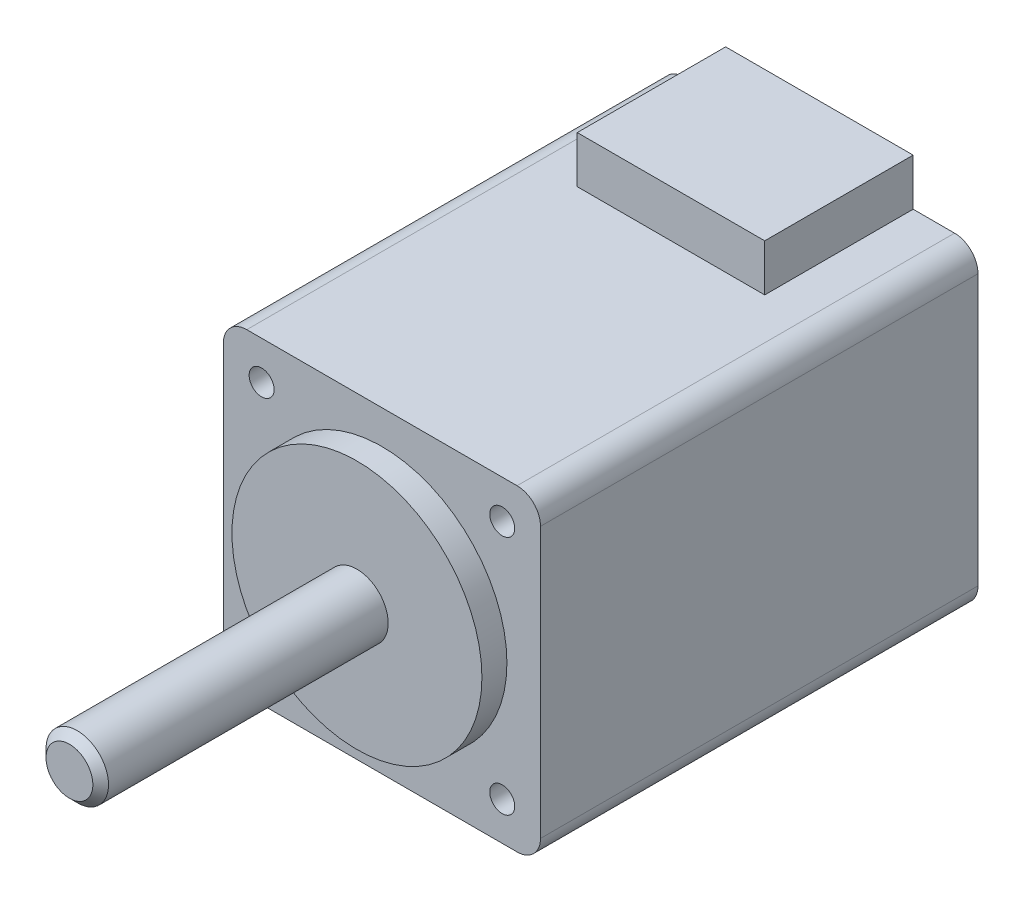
from build123d import *

# Parameters (mm, degrees)
SKETCH_1_R             = 8
EXTRUDE_1_DEPTH        = 1.6
SKETCH_2_R             = 2
EXTRUDE_2_DEPTH        = 18.4
CHAMFER_1_SIZE         = 0.5
EXTRUDE_3_DEPTH        = 28
EXTRUDE_4_DEPTH        = 9.5
HOLE_WIZARD_M2_1_D     = 1.6
HOLE_WIZARD_M2_1_DEPTH = 5.5
HOLE_WIZARD_M2_1_TIP   = 0.480688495


with BuildPart() as part:
    # Sketch 1 → Extrude 1 (new body)
    with BuildSketch(Plane.XY):
        Circle(SKETCH_1_R)
    extrude(amount=-EXTRUDE_1_DEPTH)

    # Sketch 2 → Extrude 2 (add)
    with BuildSketch(Plane.XY):
        Circle(SKETCH_2_R)
    extrude(amount=EXTRUDE_2_DEPTH)

    # Chamfer 1
    chamfer_1_edges = [part.edges().sort_by_distance(p)[0] for p in [
        (-2, 0, 18.4),
    ]]
    chamfer(chamfer_1_edges, length=CHAMFER_1_SIZE)

    # Sketch 4 → Extrude 3 (add)
    with BuildSketch(Plane(origin=(0, 0, -1.6), x_dir=(-1, 0, 0), z_dir=(0, 0, -1))):
        with BuildLine():
            Line((0, 10.15), (8.65, 10.15))
            ThreePointArc((8.65, 10.15), (9.710660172, 9.710660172), (10.15, 8.65))
            Line((10.15, 8.65), (10.15, -8.65))
            ThreePointArc((10.15, -8.65), (9.710660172, -9.710660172), (8.65, -10.15))
            Line((8.65, -10.15), (-8.65, -10.15))
            ThreePointArc((-8.65, -10.15), (-9.710660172, -9.710660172), (-10.15, -8.65))
            Line((-10.15, -8.65), (-10.15, 8.65))
            ThreePointArc((-10.15, 8.65), (-9.710660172, 9.710660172), (-8.65, 10.15))
            Line((-8.65, 10.15), (0, 10.15))
        make_face()
    extrude(amount=EXTRUDE_3_DEPTH)

    # Sketch 6 → Extrude 4 (add)
    with BuildSketch(Plane(origin=(0, 0, -29.6), x_dir=(-1, 0, 0), z_dir=(0, 0, -1))):
        Polygon((0, 10.15), (6, 10.15), (6, 13.15), (-6, 13.15), (-6, 10.15), align=None)
    extrude(amount=-EXTRUDE_4_DEPTH)

    # Hole Wizard M2 _1
    with Locations(Plane.XY.offset(-1.6)):
        with Locations((-7.7, 7.7), (7.7, 7.7), (7.7, -7.7), (-7.7, -7.7)):
            Hole(HOLE_WIZARD_M2_1_D / 2, depth=HOLE_WIZARD_M2_1_DEPTH)
            with Locations((0, 0, -(HOLE_WIZARD_M2_1_DEPTH + HOLE_WIZARD_M2_1_TIP / 2))):  # 118° drill point
                Cone(0, HOLE_WIZARD_M2_1_D / 2, HOLE_WIZARD_M2_1_TIP, mode=Mode.SUBTRACT)


solid = part.part
